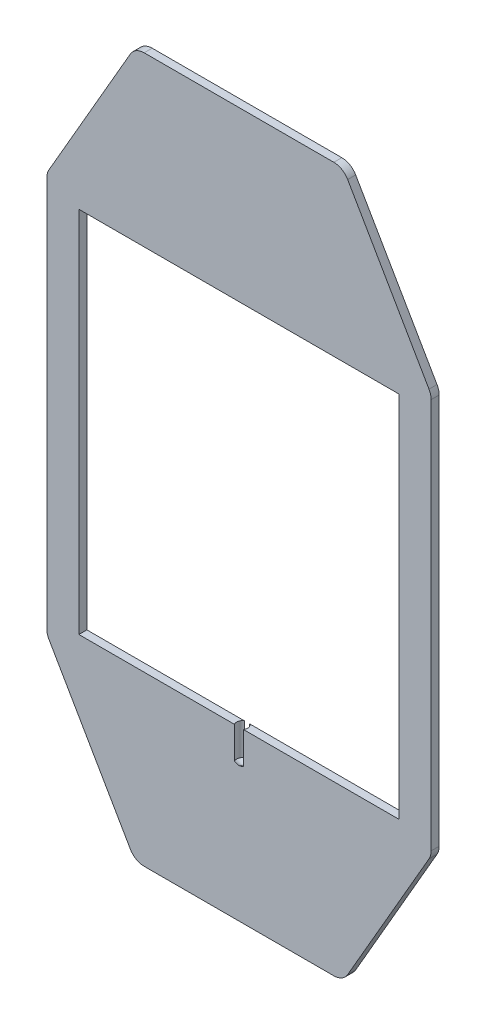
ISO-10303-21;
HEADER;
FILE_DESCRIPTION(('STEP AP214'),'2;1');
FILE_NAME('part.step','',(''),(''),'','','');
FILE_SCHEMA(('AUTOMOTIVE_DESIGN { 1 0 10303 214 1 1 1 1 }'));
ENDSEC;
DATA;
#1=APPLICATION_CONTEXT('core data for automotive mechanical design processes');
#2=APPLICATION_PROTOCOL_DEFINITION('international standard','automotive_design',2000,#1);
#3=PRODUCT_CONTEXT('',#1,'mechanical');
#4=PRODUCT('Part','Part','',(#3));
#5=PRODUCT_RELATED_PRODUCT_CATEGORY('part','',(#4));
#6=PRODUCT_DEFINITION_FORMATION('','',#4);
#7=PRODUCT_DEFINITION_CONTEXT('part definition',#1,'design');
#8=PRODUCT_DEFINITION('design','',#6,#7);
#9=PRODUCT_DEFINITION_SHAPE('','',#8);
#10=(LENGTH_UNIT() NAMED_UNIT(*) SI_UNIT(.MILLI.,.METRE.));
#11=(NAMED_UNIT(*) PLANE_ANGLE_UNIT() SI_UNIT($,.RADIAN.));
#12=(NAMED_UNIT(*) SI_UNIT($,.STERADIAN.) SOLID_ANGLE_UNIT());
#13=UNCERTAINTY_MEASURE_WITH_UNIT(LENGTH_MEASURE(1.E-05),#10,'distance_accuracy_value','');
#14=(GEOMETRIC_REPRESENTATION_CONTEXT(3) GLOBAL_UNCERTAINTY_ASSIGNED_CONTEXT((#13)) GLOBAL_UNIT_ASSIGNED_CONTEXT((#10,
#11,#12)) REPRESENTATION_CONTEXT('',''));
#15=CARTESIAN_POINT('',(0.,0.,0.));
#16=DIRECTION('',(0.,0.,1.));
#17=DIRECTION('',(1.,0.,0.));
#18=AXIS2_PLACEMENT_3D('',#15,#16,#17);
#19=CARTESIAN_POINT('',(-37.5,-115.,-10.));
#20=DIRECTION('',(0.,-1.,0.));
#21=DIRECTION('',(0.,0.,-1.));
#22=AXIS2_PLACEMENT_3D('',#19,#20,#21);
#23=PLANE('',#22);
#24=DIRECTION('',(0.,0.,1.));
#25=VECTOR('',#24,1.);
#26=CARTESIAN_POINT('',(-100.,-115.,-10.));
#27=LINE('',#26,#25);
#28=CARTESIAN_POINT('',(-99.9999999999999,-115.,-25.));
#29=VERTEX_POINT('',#28);
#30=CARTESIAN_POINT('',(-99.9999999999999,-115.,-20.));
#31=VERTEX_POINT('',#30);
#32=EDGE_CURVE('E268',#29,#31,#27,.T.);
#33=ORIENTED_EDGE('',*,*,#32,.T.);
#34=DIRECTION('',(1.,0.,0.));
#35=VECTOR('',#34,1.);
#36=CARTESIAN_POINT('',(0.,-115.,-20.));
#37=LINE('',#36,#35);
#38=CARTESIAN_POINT('',(-2.74954541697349,-115.,-20.));
#39=VERTEX_POINT('',#38);
#40=EDGE_CURVE('E263',#31,#39,#37,.T.);
#41=ORIENTED_EDGE('',*,*,#40,.T.);
#42=CARTESIAN_POINT('',(0.,-115.,-22.));
#43=DIRECTION('',(0.,1.,0.));
#44=DIRECTION('',(0.,0.,1.));
#45=AXIS2_PLACEMENT_3D('',#42,#43,#44);
#46=CIRCLE('',#45,3.39999999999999);
#47=CARTESIAN_POINT('',(-1.59999999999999,-115.,-25.));
#48=VERTEX_POINT('',#47);
#49=EDGE_CURVE('E42',#48,#39,#46,.T.);
#50=ORIENTED_EDGE('',*,*,#49,.F.);
#51=DIRECTION('',(-1.,0.,0.));
#52=VECTOR('',#51,1.);
#53=CARTESIAN_POINT('',(99.9999999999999,-115.,-25.));
#54=LINE('',#53,#52);
#55=EDGE_CURVE('E258',#48,#29,#54,.T.);
#56=ORIENTED_EDGE('',*,*,#55,.T.);
#57=EDGE_LOOP('',(#33,#41,#50,#56));
#58=FACE_BOUND('',#57,.T.);
#59=ADVANCED_FACE('F38',(#58),#23,.F.);
#60=CARTESIAN_POINT('',(0.,-115.,-22.));
#61=DIRECTION('',(0.,1.,0.));
#62=DIRECTION('',(0.,0.,1.));
#63=AXIS2_PLACEMENT_3D('',#60,#61,#62);
#64=CYLINDRICAL_SURFACE('',#63,3.39999999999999);
#65=ORIENTED_EDGE('',*,*,#49,.T.);
#66=DIRECTION('',(0.,1.,0.));
#67=VECTOR('',#66,1.);
#68=CARTESIAN_POINT('',(-2.74954541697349,-115.,-20.));
#69=LINE('',#68,#67);
#70=CARTESIAN_POINT('',(-2.74954541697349,-135.,-20.));
#71=VERTEX_POINT('',#70);
#72=EDGE_CURVE('E257',#39,#71,#69,.F.);
#73=ORIENTED_EDGE('',*,*,#72,.T.);
#74=CARTESIAN_POINT('',(0.,-135.,-22.));
#75=DIRECTION('',(0.,1.,0.));
#76=DIRECTION('',(0.,0.,1.));
#77=AXIS2_PLACEMENT_3D('',#74,#75,#76);
#78=CIRCLE('',#77,3.39999999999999);
#79=CARTESIAN_POINT('',(-1.6,-135.,-25.));
#80=VERTEX_POINT('',#79);
#81=EDGE_CURVE('E283',#80,#71,#78,.T.);
#82=ORIENTED_EDGE('',*,*,#81,.F.);
#83=DIRECTION('',(0.,1.,0.));
#84=VECTOR('',#83,1.);
#85=CARTESIAN_POINT('',(-1.59999999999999,-115.,-25.));
#86=LINE('',#85,#84);
#87=EDGE_CURVE('E261',#80,#48,#86,.T.);
#88=ORIENTED_EDGE('',*,*,#87,.T.);
#89=EDGE_LOOP('',(#65,#73,#82,#88));
#90=FACE_BOUND('',#89,.T.);
#91=ADVANCED_FACE('F221',(#90),#64,.F.);
#92=CARTESIAN_POINT('',(99.9999999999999,116.666666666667,30.));
#93=DIRECTION('',(-1.,0.,0.));
#94=DIRECTION('',(0.,-1.,0.));
#95=AXIS2_PLACEMENT_3D('',#92,#93,#94);
#96=PLANE('',#95);
#97=DIRECTION('',(0.,1.,0.));
#98=VECTOR('',#97,1.);
#99=CARTESIAN_POINT('',(99.9999999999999,0.,-20.));
#100=LINE('',#99,#98);
#101=CARTESIAN_POINT('',(99.9999999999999,-115.,-20.));
#102=VERTEX_POINT('',#101);
#103=CARTESIAN_POINT('',(99.9999999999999,115.,-20.));
#104=VERTEX_POINT('',#103);
#105=EDGE_CURVE('E127',#102,#104,#100,.T.);
#106=ORIENTED_EDGE('',*,*,#105,.T.);
#107=DIRECTION('',(0.,0.,1.));
#108=VECTOR('',#107,1.);
#109=CARTESIAN_POINT('',(100.,115.,-10.));
#110=LINE('',#109,#108);
#111=CARTESIAN_POINT('',(99.9999999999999,115.,-25.));
#112=VERTEX_POINT('',#111);
#113=EDGE_CURVE('E276',#112,#104,#110,.T.);
#114=ORIENTED_EDGE('',*,*,#113,.F.);
#115=DIRECTION('',(0.,-1.,0.));
#116=VECTOR('',#115,1.);
#117=CARTESIAN_POINT('',(99.9999999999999,115.,-25.));
#118=LINE('',#117,#116);
#119=CARTESIAN_POINT('',(99.9999999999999,-115.,-25.));
#120=VERTEX_POINT('',#119);
#121=EDGE_CURVE('E372',#112,#120,#118,.T.);
#122=ORIENTED_EDGE('',*,*,#121,.T.);
#123=DIRECTION('',(0.,0.,1.));
#124=VECTOR('',#123,1.);
#125=CARTESIAN_POINT('',(100.,-115.,-10.));
#126=LINE('',#125,#124);
#127=EDGE_CURVE('E318',#120,#102,#126,.T.);
#128=ORIENTED_EDGE('',*,*,#127,.T.);
#129=EDGE_LOOP('',(#106,#114,#122,#128));
#130=FACE_BOUND('',#129,.T.);
#131=ADVANCED_FACE('F231',(#130),#96,.T.);
#132=CARTESIAN_POINT('',(-100.,116.666666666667,30.));
#133=DIRECTION('',(1.,0.,0.));
#134=DIRECTION('',(0.,1.,0.));
#135=AXIS2_PLACEMENT_3D('',#132,#133,#134);
#136=PLANE('',#135);
#137=DIRECTION('',(0.,-1.,0.));
#138=VECTOR('',#137,1.);
#139=CARTESIAN_POINT('',(-99.9999999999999,0.,-20.));
#140=LINE('',#139,#138);
#141=CARTESIAN_POINT('',(-99.9999999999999,115.,-20.));
#142=VERTEX_POINT('',#141);
#143=EDGE_CURVE('E315',#142,#31,#140,.T.);
#144=ORIENTED_EDGE('',*,*,#143,.T.);
#145=ORIENTED_EDGE('',*,*,#32,.F.);
#146=DIRECTION('',(0.,1.,0.));
#147=VECTOR('',#146,1.);
#148=CARTESIAN_POINT('',(-99.9999999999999,115.,-25.));
#149=LINE('',#148,#147);
#150=CARTESIAN_POINT('',(-99.9999999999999,115.,-25.));
#151=VERTEX_POINT('',#150);
#152=EDGE_CURVE('E317',#29,#151,#149,.T.);
#153=ORIENTED_EDGE('',*,*,#152,.T.);
#154=DIRECTION('',(0.,0.,-1.));
#155=VECTOR('',#154,1.);
#156=CARTESIAN_POINT('',(-100.,115.,30.));
#157=LINE('',#156,#155);
#158=EDGE_CURVE('E300',#142,#151,#157,.T.);
#159=ORIENTED_EDGE('',*,*,#158,.F.);
#160=EDGE_LOOP('',(#144,#145,#153,#159));
#161=FACE_BOUND('',#160,.T.);
#162=ADVANCED_FACE('F245',(#161),#136,.T.);
#163=CARTESIAN_POINT('',(-37.5,115.,-10.));
#164=DIRECTION('',(0.,-1.,0.));
#165=DIRECTION('',(0.,0.,-1.));
#166=AXIS2_PLACEMENT_3D('',#163,#164,#165);
#167=PLANE('',#166);
#168=DIRECTION('',(-1.,0.,0.));
#169=VECTOR('',#168,1.);
#170=CARTESIAN_POINT('',(0.,115.,-20.));
#171=LINE('',#170,#169);
#172=EDGE_CURVE('E124',#104,#142,#171,.T.);
#173=ORIENTED_EDGE('',*,*,#172,.T.);
#174=ORIENTED_EDGE('',*,*,#158,.T.);
#175=DIRECTION('',(1.,0.,0.));
#176=VECTOR('',#175,1.);
#177=CARTESIAN_POINT('',(99.9999999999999,115.,-25.));
#178=LINE('',#177,#176);
#179=EDGE_CURVE('E279',#151,#112,#178,.T.);
#180=ORIENTED_EDGE('',*,*,#179,.T.);
#181=ORIENTED_EDGE('',*,*,#113,.T.);
#182=EDGE_LOOP('',(#173,#174,#180,#181));
#183=FACE_BOUND('',#182,.T.);
#184=ADVANCED_FACE('F236',(#183),#167,.T.);
#185=CARTESIAN_POINT('',(2.74954541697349,-115.,-20.));
#186=VERTEX_POINT('',#185);
#187=CARTESIAN_POINT('',(1.59999999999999,-115.,-25.));
#188=VERTEX_POINT('',#187);
#189=EDGE_CURVE('E48',#186,#188,#46,.T.);
#190=ORIENTED_EDGE('',*,*,#189,.F.);
#191=DIRECTION('',(1.,0.,0.));
#192=VECTOR('',#191,1.);
#193=CARTESIAN_POINT('',(0.,-115.,-20.));
#194=LINE('',#193,#192);
#195=EDGE_CURVE('E130',#186,#102,#194,.T.);
#196=ORIENTED_EDGE('',*,*,#195,.T.);
#197=ORIENTED_EDGE('',*,*,#127,.F.);
#198=EDGE_CURVE('E252',#120,#188,#54,.T.);
#199=ORIENTED_EDGE('',*,*,#198,.T.);
#200=EDGE_LOOP('',(#190,#196,#197,#199));
#201=FACE_BOUND('',#200,.T.);
#202=ADVANCED_FACE('F40',(#201),#23,.F.);
#203=CARTESIAN_POINT('',(118.660254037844,127.025650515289,30.));
#204=DIRECTION('',(-0.866025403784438,-0.500000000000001,0.));
#205=DIRECTION('',(0.500000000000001,-0.866025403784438,0.));
#206=AXIS2_PLACEMENT_3D('',#203,#204,#205);
#207=PLANE('',#206);
#208=DIRECTION('',(0.,0.,-1.));
#209=VECTOR('',#208,1.);
#210=CARTESIAN_POINT('',(67.8682396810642,215.,30.));
#211=LINE('',#210,#209);
#212=CARTESIAN_POINT('',(67.8682396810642,215.,-20.));
#213=VERTEX_POINT('',#212);
#214=CARTESIAN_POINT('',(67.8682396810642,215.,-25.));
#215=VERTEX_POINT('',#214);
#216=EDGE_CURVE('E392',#213,#215,#211,.T.);
#217=ORIENTED_EDGE('',*,*,#216,.F.);
#218=DIRECTION('',(0.500000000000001,-0.866025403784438,0.));
#219=VECTOR('',#218,1.);
#220=CARTESIAN_POINT('',(118.660254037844,127.025650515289,-20.));
#221=LINE('',#220,#219);
#222=CARTESIAN_POINT('',(118.660254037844,127.025650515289,-20.));
#223=VERTEX_POINT('',#222);
#224=EDGE_CURVE('E272',#213,#223,#221,.T.);
#225=ORIENTED_EDGE('',*,*,#224,.T.);
#226=DIRECTION('',(0.,0.,-1.));
#227=VECTOR('',#226,1.);
#228=CARTESIAN_POINT('',(118.660254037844,127.025650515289,30.));
#229=LINE('',#228,#227);
#230=CARTESIAN_POINT('',(118.660254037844,127.025650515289,-25.));
#231=VERTEX_POINT('',#230);
#232=EDGE_CURVE('E274',#223,#231,#229,.T.);
#233=ORIENTED_EDGE('',*,*,#232,.T.);
#234=DIRECTION('',(0.500000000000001,-0.866025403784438,0.));
#235=VECTOR('',#234,1.);
#236=CARTESIAN_POINT('',(67.8682396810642,215.,-25.));
#237=LINE('',#236,#235);
#238=EDGE_CURVE('E349',#215,#231,#237,.T.);
#239=ORIENTED_EDGE('',*,*,#238,.F.);
#240=EDGE_LOOP('',(#217,#225,#233,#239));
#241=FACE_BOUND('',#240,.T.);
#242=ADVANCED_FACE('F235',(#241),#207,.F.);
#243=CARTESIAN_POINT('',(118.660254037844,-127.025650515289,30.));
#244=DIRECTION('',(-0.866025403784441,0.499999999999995,0.));
#245=DIRECTION('',(-0.499999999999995,-0.866025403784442,0.));
#246=AXIS2_PLACEMENT_3D('',#243,#244,#245);
#247=PLANE('',#246);
#248=DIRECTION('',(0.,0.,-1.));
#249=VECTOR('',#248,1.);
#250=CARTESIAN_POINT('',(118.660254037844,-127.025650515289,30.));
#251=LINE('',#250,#249);
#252=CARTESIAN_POINT('',(118.660254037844,-127.025650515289,-20.));
#253=VERTEX_POINT('',#252);
#254=CARTESIAN_POINT('',(118.660254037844,-127.025650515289,-25.));
#255=VERTEX_POINT('',#254);
#256=EDGE_CURVE('E403',#253,#255,#251,.T.);
#257=ORIENTED_EDGE('',*,*,#256,.F.);
#258=DIRECTION('',(-0.499999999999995,-0.866025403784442,0.));
#259=VECTOR('',#258,1.);
#260=CARTESIAN_POINT('',(118.660254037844,-127.025650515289,-20.));
#261=LINE('',#260,#259);
#262=CARTESIAN_POINT('',(67.8682396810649,-215.,-20.));
#263=VERTEX_POINT('',#262);
#264=EDGE_CURVE('E396',#253,#263,#261,.T.);
#265=ORIENTED_EDGE('',*,*,#264,.T.);
#266=DIRECTION('',(0.,0.,-1.));
#267=VECTOR('',#266,1.);
#268=CARTESIAN_POINT('',(67.8682396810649,-215.,30.));
#269=LINE('',#268,#267);
#270=CARTESIAN_POINT('',(67.8682396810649,-215.,-25.));
#271=VERTEX_POINT('',#270);
#272=EDGE_CURVE('E406',#263,#271,#269,.T.);
#273=ORIENTED_EDGE('',*,*,#272,.T.);
#274=DIRECTION('',(-0.499999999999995,-0.866025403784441,0.));
#275=VECTOR('',#274,1.);
#276=CARTESIAN_POINT('',(118.660254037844,-127.025650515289,-25.));
#277=LINE('',#276,#275);
#278=EDGE_CURVE('E361',#255,#271,#277,.T.);
#279=ORIENTED_EDGE('',*,*,#278,.F.);
#280=EDGE_LOOP('',(#257,#265,#273,#279));
#281=FACE_BOUND('',#280,.T.);
#282=ADVANCED_FACE('F242',(#281),#247,.F.);
#283=CARTESIAN_POINT('',(110.,-122.025650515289,30.));
#284=DIRECTION('',(0.,0.,-1.));
#285=DIRECTION('',(-1.,0.,0.));
#286=AXIS2_PLACEMENT_3D('',#283,#284,#285);
#287=CYLINDRICAL_SURFACE('',#286,9.99999999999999);
#288=DIRECTION('',(0.,0.,-1.));
#289=VECTOR('',#288,1.);
#290=CARTESIAN_POINT('',(120.,-122.025650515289,30.));
#291=LINE('',#290,#289);
#292=CARTESIAN_POINT('',(120.,-122.025650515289,-20.));
#293=VERTEX_POINT('',#292);
#294=CARTESIAN_POINT('',(120.,-122.025650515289,-25.));
#295=VERTEX_POINT('',#294);
#296=EDGE_CURVE('E400',#293,#295,#291,.T.);
#297=ORIENTED_EDGE('',*,*,#296,.F.);
#298=CARTESIAN_POINT('',(110.,-122.025650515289,-20.));
#299=DIRECTION('',(0.,0.,-1.));
#300=DIRECTION('',(-1.,0.,0.));
#301=AXIS2_PLACEMENT_3D('',#298,#299,#300);
#302=CIRCLE('',#301,9.99999999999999);
#303=EDGE_CURVE('E405',#293,#253,#302,.T.);
#304=ORIENTED_EDGE('',*,*,#303,.T.);
#305=ORIENTED_EDGE('',*,*,#256,.T.);
#306=CARTESIAN_POINT('',(110.,-122.025650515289,-25.));
#307=DIRECTION('',(0.,0.,-1.));
#308=DIRECTION('',(-1.,0.,0.));
#309=AXIS2_PLACEMENT_3D('',#306,#307,#308);
#310=CIRCLE('',#309,9.99999999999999);
#311=EDGE_CURVE('E358',#295,#255,#310,.T.);
#312=ORIENTED_EDGE('',*,*,#311,.F.);
#313=EDGE_LOOP('',(#297,#304,#305,#312));
#314=FACE_BOUND('',#313,.T.);
#315=ADVANCED_FACE('F475',(#314),#287,.T.);
#316=CARTESIAN_POINT('',(120.,122.025650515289,30.));
#317=DIRECTION('',(-1.,0.,0.));
#318=DIRECTION('',(0.,-1.,0.));
#319=AXIS2_PLACEMENT_3D('',#316,#317,#318);
#320=PLANE('',#319);
#321=DIRECTION('',(0.,0.,-1.));
#322=VECTOR('',#321,1.);
#323=CARTESIAN_POINT('',(120.,122.025650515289,30.));
#324=LINE('',#323,#322);
#325=CARTESIAN_POINT('',(120.,122.025650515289,-20.));
#326=VERTEX_POINT('',#325);
#327=CARTESIAN_POINT('',(120.,122.025650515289,-25.));
#328=VERTEX_POINT('',#327);
#329=EDGE_CURVE('E397',#326,#328,#324,.T.);
#330=ORIENTED_EDGE('',*,*,#329,.F.);
#331=DIRECTION('',(0.,-1.,0.));
#332=VECTOR('',#331,1.);
#333=CARTESIAN_POINT('',(120.,122.025650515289,-20.));
#334=LINE('',#333,#332);
#335=EDGE_CURVE('E402',#326,#293,#334,.T.);
#336=ORIENTED_EDGE('',*,*,#335,.T.);
#337=ORIENTED_EDGE('',*,*,#296,.T.);
#338=DIRECTION('',(0.,-1.,0.));
#339=VECTOR('',#338,1.);
#340=CARTESIAN_POINT('',(120.,122.025650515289,-25.));
#341=LINE('',#340,#339);
#342=EDGE_CURVE('E355',#328,#295,#341,.T.);
#343=ORIENTED_EDGE('',*,*,#342,.F.);
#344=EDGE_LOOP('',(#330,#336,#337,#343));
#345=FACE_BOUND('',#344,.T.);
#346=ADVANCED_FACE('F470',(#345),#320,.F.);
#347=CARTESIAN_POINT('',(110.,122.025650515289,30.));
#348=DIRECTION('',(0.,0.,-1.));
#349=DIRECTION('',(-1.,0.,0.));
#350=AXIS2_PLACEMENT_3D('',#347,#348,#349);
#351=CYLINDRICAL_SURFACE('',#350,10.);
#352=ORIENTED_EDGE('',*,*,#232,.F.);
#353=CARTESIAN_POINT('',(110.,122.025650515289,-20.));
#354=DIRECTION('',(0.,0.,-1.));
#355=DIRECTION('',(-1.,0.,0.));
#356=AXIS2_PLACEMENT_3D('',#353,#354,#355);
#357=CIRCLE('',#356,10.);
#358=EDGE_CURVE('E399',#223,#326,#357,.T.);
#359=ORIENTED_EDGE('',*,*,#358,.T.);
#360=ORIENTED_EDGE('',*,*,#329,.T.);
#361=CARTESIAN_POINT('',(110.,122.025650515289,-25.));
#362=DIRECTION('',(0.,0.,-1.));
#363=DIRECTION('',(-1.,0.,0.));
#364=AXIS2_PLACEMENT_3D('',#361,#362,#363);
#365=CIRCLE('',#364,9.99999999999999);
#366=EDGE_CURVE('E352',#231,#328,#365,.T.);
#367=ORIENTED_EDGE('',*,*,#366,.F.);
#368=EDGE_LOOP('',(#352,#359,#360,#367));
#369=FACE_BOUND('',#368,.T.);
#370=ADVANCED_FACE('F465',(#369),#351,.T.);
#371=CARTESIAN_POINT('',(59.2079856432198,210.,30.));
#372=DIRECTION('',(0.,0.,-1.));
#373=DIRECTION('',(-1.,0.,0.));
#374=AXIS2_PLACEMENT_3D('',#371,#372,#373);
#375=CYLINDRICAL_SURFACE('',#374,10.);
#376=DIRECTION('',(0.,0.,-1.));
#377=VECTOR('',#376,1.);
#378=CARTESIAN_POINT('',(59.2079856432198,220.,30.));
#379=LINE('',#378,#377);
#380=CARTESIAN_POINT('',(59.2079856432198,220.,-20.));
#381=VERTEX_POINT('',#380);
#382=CARTESIAN_POINT('',(59.2079856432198,220.,-25.));
#383=VERTEX_POINT('',#382);
#384=EDGE_CURVE('E389',#381,#383,#379,.T.);
#385=ORIENTED_EDGE('',*,*,#384,.F.);
#386=CARTESIAN_POINT('',(59.2079856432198,210.,-20.));
#387=DIRECTION('',(0.,0.,-1.));
#388=DIRECTION('',(-1.,0.,0.));
#389=AXIS2_PLACEMENT_3D('',#386,#387,#388);
#390=CIRCLE('',#389,10.);
#391=EDGE_CURVE('E394',#381,#213,#390,.T.);
#392=ORIENTED_EDGE('',*,*,#391,.T.);
#393=ORIENTED_EDGE('',*,*,#216,.T.);
#394=CARTESIAN_POINT('',(59.2079856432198,210.,-25.));
#395=DIRECTION('',(0.,0.,-1.));
#396=DIRECTION('',(-1.,0.,0.));
#397=AXIS2_PLACEMENT_3D('',#394,#395,#396);
#398=CIRCLE('',#397,10.);
#399=EDGE_CURVE('E346',#383,#215,#398,.T.);
#400=ORIENTED_EDGE('',*,*,#399,.F.);
#401=EDGE_LOOP('',(#385,#392,#393,#400));
#402=FACE_BOUND('',#401,.T.);
#403=ADVANCED_FACE('F459',(#402),#375,.T.);
#404=CARTESIAN_POINT('',(59.2079856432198,220.,30.));
#405=DIRECTION('',(0.,-1.,0.));
#406=DIRECTION('',(0.,0.,-1.));
#407=AXIS2_PLACEMENT_3D('',#404,#405,#406);
#408=PLANE('',#407);
#409=DIRECTION('',(0.,0.,-1.));
#410=VECTOR('',#409,1.);
#411=CARTESIAN_POINT('',(-59.2079856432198,220.,30.));
#412=LINE('',#411,#410);
#413=CARTESIAN_POINT('',(-59.2079856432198,220.,-20.));
#414=VERTEX_POINT('',#413);
#415=CARTESIAN_POINT('',(-59.2079856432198,220.,-25.));
#416=VERTEX_POINT('',#415);
#417=EDGE_CURVE('E386',#414,#416,#412,.T.);
#418=ORIENTED_EDGE('',*,*,#417,.F.);
#419=DIRECTION('',(1.,0.,0.));
#420=VECTOR('',#419,1.);
#421=CARTESIAN_POINT('',(59.2079856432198,220.,-20.));
#422=LINE('',#421,#420);
#423=EDGE_CURVE('E391',#414,#381,#422,.T.);
#424=ORIENTED_EDGE('',*,*,#423,.T.);
#425=ORIENTED_EDGE('',*,*,#384,.T.);
#426=DIRECTION('',(1.,0.,0.));
#427=VECTOR('',#426,1.);
#428=CARTESIAN_POINT('',(-59.2079856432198,220.,-25.));
#429=LINE('',#428,#427);
#430=EDGE_CURVE('E343',#416,#383,#429,.T.);
#431=ORIENTED_EDGE('',*,*,#430,.F.);
#432=EDGE_LOOP('',(#418,#424,#425,#431));
#433=FACE_BOUND('',#432,.T.);
#434=ADVANCED_FACE('F454',(#433),#408,.F.);
#435=CARTESIAN_POINT('',(-59.2079856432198,210.,30.));
#436=DIRECTION('',(0.,0.,-1.));
#437=DIRECTION('',(-1.,0.,0.));
#438=AXIS2_PLACEMENT_3D('',#435,#436,#437);
#439=CYLINDRICAL_SURFACE('',#438,10.);
#440=DIRECTION('',(0.,0.,-1.));
#441=VECTOR('',#440,1.);
#442=CARTESIAN_POINT('',(-67.8682396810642,215.,30.));
#443=LINE('',#442,#441);
#444=CARTESIAN_POINT('',(-67.8682396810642,215.,-20.));
#445=VERTEX_POINT('',#444);
#446=CARTESIAN_POINT('',(-67.8682396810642,215.,-25.));
#447=VERTEX_POINT('',#446);
#448=EDGE_CURVE('E383',#445,#447,#443,.T.);
#449=ORIENTED_EDGE('',*,*,#448,.F.);
#450=CARTESIAN_POINT('',(-59.2079856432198,210.,-20.));
#451=DIRECTION('',(0.,0.,-1.));
#452=DIRECTION('',(-1.,0.,0.));
#453=AXIS2_PLACEMENT_3D('',#450,#451,#452);
#454=CIRCLE('',#453,10.);
#455=EDGE_CURVE('E388',#445,#414,#454,.T.);
#456=ORIENTED_EDGE('',*,*,#455,.T.);
#457=ORIENTED_EDGE('',*,*,#417,.T.);
#458=CARTESIAN_POINT('',(-59.2079856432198,210.,-25.));
#459=DIRECTION('',(0.,0.,-1.));
#460=DIRECTION('',(-1.,0.,0.));
#461=AXIS2_PLACEMENT_3D('',#458,#459,#460);
#462=CIRCLE('',#461,10.);
#463=EDGE_CURVE('E340',#447,#416,#462,.T.);
#464=ORIENTED_EDGE('',*,*,#463,.F.);
#465=EDGE_LOOP('',(#449,#456,#457,#464));
#466=FACE_BOUND('',#465,.T.);
#467=ADVANCED_FACE('F451',(#466),#439,.T.);
#468=CARTESIAN_POINT('',(-118.660254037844,127.025650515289,30.));
#469=DIRECTION('',(0.866025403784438,-0.500000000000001,0.));
#470=DIRECTION('',(0.500000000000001,0.866025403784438,0.));
#471=AXIS2_PLACEMENT_3D('',#468,#469,#470);
#472=PLANE('',#471);
#473=DIRECTION('',(0.,0.,-1.));
#474=VECTOR('',#473,1.);
#475=CARTESIAN_POINT('',(-118.660254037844,127.025650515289,30.));
#476=LINE('',#475,#474);
#477=CARTESIAN_POINT('',(-118.660254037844,127.025650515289,-20.));
#478=VERTEX_POINT('',#477);
#479=CARTESIAN_POINT('',(-118.660254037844,127.025650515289,-25.));
#480=VERTEX_POINT('',#479);
#481=EDGE_CURVE('E380',#478,#480,#476,.T.);
#482=ORIENTED_EDGE('',*,*,#481,.F.);
#483=DIRECTION('',(0.500000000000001,0.866025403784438,0.));
#484=VECTOR('',#483,1.);
#485=CARTESIAN_POINT('',(-118.660254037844,127.025650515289,-20.));
#486=LINE('',#485,#484);
#487=EDGE_CURVE('E385',#478,#445,#486,.T.);
#488=ORIENTED_EDGE('',*,*,#487,.T.);
#489=ORIENTED_EDGE('',*,*,#448,.T.);
#490=DIRECTION('',(0.500000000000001,0.866025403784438,0.));
#491=VECTOR('',#490,1.);
#492=CARTESIAN_POINT('',(-118.660254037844,127.025650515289,-25.));
#493=LINE('',#492,#491);
#494=EDGE_CURVE('E337',#480,#447,#493,.T.);
#495=ORIENTED_EDGE('',*,*,#494,.F.);
#496=EDGE_LOOP('',(#482,#488,#489,#495));
#497=FACE_BOUND('',#496,.T.);
#498=ADVANCED_FACE('F445',(#497),#472,.F.);
#499=CARTESIAN_POINT('',(-110.,-122.025650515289,30.));
#500=DIRECTION('',(0.,0.,-1.));
#501=DIRECTION('',(-1.,0.,0.));
#502=AXIS2_PLACEMENT_3D('',#499,#500,#501);
#503=CYLINDRICAL_SURFACE('',#502,9.99999999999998);
#504=DIRECTION('',(0.,0.,-1.));
#505=VECTOR('',#504,1.);
#506=CARTESIAN_POINT('',(-118.660254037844,-127.025650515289,30.));
#507=LINE('',#506,#505);
#508=CARTESIAN_POINT('',(-118.660254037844,-127.025650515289,-20.));
#509=VERTEX_POINT('',#508);
#510=CARTESIAN_POINT('',(-118.660254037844,-127.025650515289,-25.));
#511=VERTEX_POINT('',#510);
#512=EDGE_CURVE('E415',#509,#511,#507,.T.);
#513=ORIENTED_EDGE('',*,*,#512,.F.);
#514=CARTESIAN_POINT('',(-110.,-122.025650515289,-20.));
#515=DIRECTION('',(0.,0.,-1.));
#516=DIRECTION('',(-1.,0.,0.));
#517=AXIS2_PLACEMENT_3D('',#514,#515,#516);
#518=CIRCLE('',#517,9.99999999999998);
#519=CARTESIAN_POINT('',(-120.,-122.025650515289,-20.));
#520=VERTEX_POINT('',#519);
#521=EDGE_CURVE('E378',#509,#520,#518,.T.);
#522=ORIENTED_EDGE('',*,*,#521,.T.);
#523=DIRECTION('',(0.,0.,-1.));
#524=VECTOR('',#523,1.);
#525=CARTESIAN_POINT('',(-120.,-122.025650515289,30.));
#526=LINE('',#525,#524);
#527=CARTESIAN_POINT('',(-120.,-122.025650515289,-25.));
#528=VERTEX_POINT('',#527);
#529=EDGE_CURVE('E375',#520,#528,#526,.T.);
#530=ORIENTED_EDGE('',*,*,#529,.T.);
#531=CARTESIAN_POINT('',(-110.,-122.025650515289,-25.));
#532=DIRECTION('',(0.,0.,-1.));
#533=DIRECTION('',(-1.,0.,0.));
#534=AXIS2_PLACEMENT_3D('',#531,#532,#533);
#535=CIRCLE('',#534,9.99999999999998);
#536=EDGE_CURVE('E327',#511,#528,#535,.T.);
#537=ORIENTED_EDGE('',*,*,#536,.F.);
#538=EDGE_LOOP('',(#513,#522,#530,#537));
#539=FACE_BOUND('',#538,.T.);
#540=ADVANCED_FACE('F496',(#539),#503,.T.);
#541=CARTESIAN_POINT('',(-118.660254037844,-127.025650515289,30.));
#542=DIRECTION('',(0.866025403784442,0.499999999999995,0.));
#543=DIRECTION('',(-0.499999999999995,0.866025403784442,0.));
#544=AXIS2_PLACEMENT_3D('',#541,#542,#543);
#545=PLANE('',#544);
#546=DIRECTION('',(0.,0.,-1.));
#547=VECTOR('',#546,1.);
#548=CARTESIAN_POINT('',(-67.8682396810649,-215.,30.));
#549=LINE('',#548,#547);
#550=CARTESIAN_POINT('',(-67.8682396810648,-215.,-20.));
#551=VERTEX_POINT('',#550);
#552=CARTESIAN_POINT('',(-67.8682396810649,-215.,-25.));
#553=VERTEX_POINT('',#552);
#554=EDGE_CURVE('E414',#551,#553,#549,.T.);
#555=ORIENTED_EDGE('',*,*,#554,.F.);
#556=DIRECTION('',(-0.499999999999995,0.866025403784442,0.));
#557=VECTOR('',#556,1.);
#558=CARTESIAN_POINT('',(-118.660254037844,-127.025650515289,-20.));
#559=LINE('',#558,#557);
#560=EDGE_CURVE('E377',#551,#509,#559,.T.);
#561=ORIENTED_EDGE('',*,*,#560,.T.);
#562=ORIENTED_EDGE('',*,*,#512,.T.);
#563=DIRECTION('',(-0.499999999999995,0.866025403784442,0.));
#564=VECTOR('',#563,1.);
#565=CARTESIAN_POINT('',(-67.8682396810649,-215.,-25.));
#566=LINE('',#565,#564);
#567=EDGE_CURVE('E285',#553,#511,#566,.T.);
#568=ORIENTED_EDGE('',*,*,#567,.F.);
#569=EDGE_LOOP('',(#555,#561,#562,#568));
#570=FACE_BOUND('',#569,.T.);
#571=ADVANCED_FACE('F493',(#570),#545,.F.);
#572=CARTESIAN_POINT('',(-59.2079856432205,-210.,30.));
#573=DIRECTION('',(0.,0.,-1.));
#574=DIRECTION('',(-1.,0.,0.));
#575=AXIS2_PLACEMENT_3D('',#572,#573,#574);
#576=CYLINDRICAL_SURFACE('',#575,10.);
#577=DIRECTION('',(0.,0.,-1.));
#578=VECTOR('',#577,1.);
#579=CARTESIAN_POINT('',(-59.2079856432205,-220.,30.));
#580=LINE('',#579,#578);
#581=CARTESIAN_POINT('',(-59.2079856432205,-220.,-20.));
#582=VERTEX_POINT('',#581);
#583=CARTESIAN_POINT('',(-59.2079856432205,-220.,-25.));
#584=VERTEX_POINT('',#583);
#585=EDGE_CURVE('E411',#582,#584,#580,.T.);
#586=ORIENTED_EDGE('',*,*,#585,.F.);
#587=CARTESIAN_POINT('',(-59.2079856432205,-210.,-20.));
#588=DIRECTION('',(0.,0.,-1.));
#589=DIRECTION('',(-1.,0.,0.));
#590=AXIS2_PLACEMENT_3D('',#587,#588,#589);
#591=CIRCLE('',#590,10.);
#592=EDGE_CURVE('E57',#582,#551,#591,.T.);
#593=ORIENTED_EDGE('',*,*,#592,.T.);
#594=ORIENTED_EDGE('',*,*,#554,.T.);
#595=CARTESIAN_POINT('',(-59.2079856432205,-210.,-25.));
#596=DIRECTION('',(0.,0.,-1.));
#597=DIRECTION('',(-1.,0.,0.));
#598=AXIS2_PLACEMENT_3D('',#595,#596,#597);
#599=CIRCLE('',#598,10.);
#600=EDGE_CURVE('E290',#584,#553,#599,.T.);
#601=ORIENTED_EDGE('',*,*,#600,.F.);
#602=EDGE_LOOP('',(#586,#593,#594,#601));
#603=FACE_BOUND('',#602,.T.);
#604=ADVANCED_FACE('F492',(#603),#576,.T.);
#605=CARTESIAN_POINT('',(59.2079856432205,-220.,30.));
#606=DIRECTION('',(0.,1.,0.));
#607=DIRECTION('',(0.,0.,1.));
#608=AXIS2_PLACEMENT_3D('',#605,#606,#607);
#609=PLANE('',#608);
#610=DIRECTION('',(0.,0.,-1.));
#611=VECTOR('',#610,1.);
#612=CARTESIAN_POINT('',(59.2079856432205,-220.,30.));
#613=LINE('',#612,#611);
#614=CARTESIAN_POINT('',(59.2079856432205,-220.,-20.));
#615=VERTEX_POINT('',#614);
#616=CARTESIAN_POINT('',(59.2079856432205,-220.,-25.));
#617=VERTEX_POINT('',#616);
#618=EDGE_CURVE('E408',#615,#617,#613,.T.);
#619=ORIENTED_EDGE('',*,*,#618,.F.);
#620=DIRECTION('',(-1.,0.,0.));
#621=VECTOR('',#620,1.);
#622=CARTESIAN_POINT('',(59.2079856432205,-220.,-20.));
#623=LINE('',#622,#621);
#624=EDGE_CURVE('E413',#615,#582,#623,.T.);
#625=ORIENTED_EDGE('',*,*,#624,.T.);
#626=ORIENTED_EDGE('',*,*,#585,.T.);
#627=DIRECTION('',(-1.,0.,0.));
#628=VECTOR('',#627,1.);
#629=CARTESIAN_POINT('',(59.2079856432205,-220.,-25.));
#630=LINE('',#629,#628);
#631=EDGE_CURVE('E367',#617,#584,#630,.T.);
#632=ORIENTED_EDGE('',*,*,#631,.F.);
#633=EDGE_LOOP('',(#619,#625,#626,#632));
#634=FACE_BOUND('',#633,.T.);
#635=ADVANCED_FACE('F488',(#634),#609,.F.);
#636=CARTESIAN_POINT('',(59.2079856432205,-210.,30.));
#637=DIRECTION('',(0.,0.,-1.));
#638=DIRECTION('',(-1.,0.,0.));
#639=AXIS2_PLACEMENT_3D('',#636,#637,#638);
#640=CYLINDRICAL_SURFACE('',#639,10.);
#641=ORIENTED_EDGE('',*,*,#272,.F.);
#642=CARTESIAN_POINT('',(59.2079856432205,-210.,-20.));
#643=DIRECTION('',(0.,0.,-1.));
#644=DIRECTION('',(-1.,0.,0.));
#645=AXIS2_PLACEMENT_3D('',#642,#643,#644);
#646=CIRCLE('',#645,10.);
#647=EDGE_CURVE('E410',#263,#615,#646,.T.);
#648=ORIENTED_EDGE('',*,*,#647,.T.);
#649=ORIENTED_EDGE('',*,*,#618,.T.);
#650=CARTESIAN_POINT('',(59.2079856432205,-210.,-25.));
#651=DIRECTION('',(0.,0.,-1.));
#652=DIRECTION('',(-1.,0.,0.));
#653=AXIS2_PLACEMENT_3D('',#650,#651,#652);
#654=CIRCLE('',#653,10.);
#655=EDGE_CURVE('E364',#271,#617,#654,.T.);
#656=ORIENTED_EDGE('',*,*,#655,.F.);
#657=EDGE_LOOP('',(#641,#648,#649,#656));
#658=FACE_BOUND('',#657,.T.);
#659=ADVANCED_FACE('F484',(#658),#640,.T.);
#660=CARTESIAN_POINT('',(-110.,122.025650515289,30.));
#661=DIRECTION('',(0.,0.,-1.));
#662=DIRECTION('',(-1.,0.,0.));
#663=AXIS2_PLACEMENT_3D('',#660,#661,#662);
#664=CYLINDRICAL_SURFACE('',#663,10.);
#665=DIRECTION('',(0.,0.,-1.));
#666=VECTOR('',#665,1.);
#667=CARTESIAN_POINT('',(-120.,122.025650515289,30.));
#668=LINE('',#667,#666);
#669=CARTESIAN_POINT('',(-120.,122.025650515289,-20.));
#670=VERTEX_POINT('',#669);
#671=CARTESIAN_POINT('',(-120.,122.025650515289,-25.));
#672=VERTEX_POINT('',#671);
#673=EDGE_CURVE('E331',#670,#672,#668,.T.);
#674=ORIENTED_EDGE('',*,*,#673,.F.);
#675=CARTESIAN_POINT('',(-110.,122.025650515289,-20.));
#676=DIRECTION('',(0.,0.,-1.));
#677=DIRECTION('',(-1.,0.,0.));
#678=AXIS2_PLACEMENT_3D('',#675,#676,#677);
#679=CIRCLE('',#678,10.);
#680=EDGE_CURVE('E382',#670,#478,#679,.T.);
#681=ORIENTED_EDGE('',*,*,#680,.T.);
#682=ORIENTED_EDGE('',*,*,#481,.T.);
#683=CARTESIAN_POINT('',(-110.,122.025650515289,-25.));
#684=DIRECTION('',(0.,0.,-1.));
#685=DIRECTION('',(-1.,0.,0.));
#686=AXIS2_PLACEMENT_3D('',#683,#684,#685);
#687=CIRCLE('',#686,10.);
#688=EDGE_CURVE('E334',#672,#480,#687,.T.);
#689=ORIENTED_EDGE('',*,*,#688,.F.);
#690=EDGE_LOOP('',(#674,#681,#682,#689));
#691=FACE_BOUND('',#690,.T.);
#692=ADVANCED_FACE('F440',(#691),#664,.T.);
#693=CARTESIAN_POINT('',(-120.,122.025650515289,30.));
#694=DIRECTION('',(1.,0.,0.));
#695=DIRECTION('',(0.,1.,0.));
#696=AXIS2_PLACEMENT_3D('',#693,#694,#695);
#697=PLANE('',#696);
#698=ORIENTED_EDGE('',*,*,#529,.F.);
#699=DIRECTION('',(0.,1.,0.));
#700=VECTOR('',#699,1.);
#701=CARTESIAN_POINT('',(-120.,122.025650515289,-20.));
#702=LINE('',#701,#700);
#703=EDGE_CURVE('E313',#520,#670,#702,.T.);
#704=ORIENTED_EDGE('',*,*,#703,.T.);
#705=ORIENTED_EDGE('',*,*,#673,.T.);
#706=DIRECTION('',(0.,1.,0.));
#707=VECTOR('',#706,1.);
#708=CARTESIAN_POINT('',(-120.,-122.025650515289,-25.));
#709=LINE('',#708,#707);
#710=EDGE_CURVE('E330',#528,#672,#709,.T.);
#711=ORIENTED_EDGE('',*,*,#710,.F.);
#712=EDGE_LOOP('',(#698,#704,#705,#711));
#713=FACE_BOUND('',#712,.T.);
#714=ADVANCED_FACE('F222',(#713),#697,.F.);
#715=CARTESIAN_POINT('',(-110.,-122.025650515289,-25.));
#716=DIRECTION('',(0.,0.,-1.));
#717=DIRECTION('',(-1.,0.,0.));
#718=AXIS2_PLACEMENT_3D('',#715,#716,#717);
#719=PLANE('',#718);
#720=ORIENTED_EDGE('',*,*,#87,.F.);
#721=CARTESIAN_POINT('',(-16.2184046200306,-127.132611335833,-25.));
#722=CARTESIAN_POINT('',(-15.7092292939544,-127.433423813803,-25.));
#723=CARTESIAN_POINT('',(-15.1998707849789,-127.733927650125,-25.));
#724=CARTESIAN_POINT('',(-14.1798951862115,-128.334413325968,-25.));
#725=CARTESIAN_POINT('',(-13.6692773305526,-128.634393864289,-25.));
#726=CARTESIAN_POINT('',(-12.6326647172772,-129.241667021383,-25.));
#727=CARTESIAN_POINT('',(-12.1066484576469,-129.548922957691,-25.));
#728=CARTESIAN_POINT('',(-11.0542278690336,-130.161080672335,-25.));
#729=CARTESIAN_POINT('',(-10.5278251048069,-130.465985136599,-25.));
#730=CARTESIAN_POINT('',(-9.64128743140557,-130.976201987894,-25.));
#731=CARTESIAN_POINT('',(-9.2816045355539,-131.182299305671,-25.));
#732=CARTESIAN_POINT('',(-8.56112299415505,-131.59263421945,-25.));
#733=CARTESIAN_POINT('',(-8.20032422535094,-131.796871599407,-25.));
#734=CARTESIAN_POINT('',(-7.47545341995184,-132.203646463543,-25.));
#735=CARTESIAN_POINT('',(-7.11137400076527,-132.406170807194,-25.));
#736=CARTESIAN_POINT('',(-6.38114447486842,-132.807102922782,-25.));
#737=CARTESIAN_POINT('',(-6.01499531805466,-133.005512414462,-25.));
#738=CARTESIAN_POINT('',(-5.46718167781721,-133.296182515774,-25.));
#739=CARTESIAN_POINT('',(-5.28681921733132,-133.390894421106,-25.));
#740=CARTESIAN_POINT('',(-4.92504906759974,-133.578315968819,-25.));
#741=CARTESIAN_POINT('',(-4.74364135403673,-133.671025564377,-25.));
#742=CARTESIAN_POINT('',(-4.37918402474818,-133.853991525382,-25.));
#743=CARTESIAN_POINT('',(-4.19613205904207,-133.944243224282,-25.));
#744=CARTESIAN_POINT('',(-3.82834245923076,-134.121231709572,-25.));
#745=CARTESIAN_POINT('',(-3.64360493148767,-134.207968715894,-25.));
#746=CARTESIAN_POINT('',(-3.27361956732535,-134.375889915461,-25.));
#747=CARTESIAN_POINT('',(-3.08839140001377,-134.457117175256,-25.));
#748=CARTESIAN_POINT('',(-2.71510553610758,-134.613057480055,-25.));
#749=CARTESIAN_POINT('',(-2.5270468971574,-134.687768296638,-25.));
#750=CARTESIAN_POINT('',(-2.14807885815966,-134.827718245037,-25.));
#751=CARTESIAN_POINT('',(-1.95718043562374,-134.89298676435,-25.));
#752=CARTESIAN_POINT('',(-1.5714463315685,-135.010460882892,-25.));
#753=CARTESIAN_POINT('',(-1.37661466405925,-135.062679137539,-25.));
#754=CARTESIAN_POINT('',(-1.14353131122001,-135.113936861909,-25.));
#755=CARTESIAN_POINT('',(-1.10714361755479,-135.121619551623,-25.));
#756=CARTESIAN_POINT('',(-1.03423348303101,-135.136345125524,-25.));
#757=CARTESIAN_POINT('',(-0.997711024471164,-135.143387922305,-25.));
#758=CARTESIAN_POINT('',(-0.887930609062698,-135.163512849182,-25.));
#759=CARTESIAN_POINT('',(-0.814484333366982,-135.175586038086,-25.));
#760=CARTESIAN_POINT('',(-0.667205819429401,-135.196801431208,-25.));
#761=CARTESIAN_POINT('',(-0.593373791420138,-135.205945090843,-25.));
#762=CARTESIAN_POINT('',(-0.4453928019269,-135.221113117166,-25.));
#763=CARTESIAN_POINT('',(-0.371243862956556,-135.227137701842,-25.));
#764=CARTESIAN_POINT('',(-0.224357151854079,-135.235832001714,-25.));
#765=CARTESIAN_POINT('',(-0.151623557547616,-135.238571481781,-25.));
#766=CARTESIAN_POINT('',(-0.0061119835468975,-135.24087141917,-25.));
#767=CARTESIAN_POINT('',(0.0666659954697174,-135.24043192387,-25.));
#768=CARTESIAN_POINT('',(0.284965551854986,-135.234331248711,-25.));
#769=CARTESIAN_POINT('',(0.430382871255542,-135.223883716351,-25.));
#770=CARTESIAN_POINT('',(0.678394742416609,-135.195842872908,-25.));
#771=CARTESIAN_POINT('',(0.781339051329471,-135.18114879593,-25.));
#772=CARTESIAN_POINT('',(0.986316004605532,-135.146340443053,-25.));
#773=CARTESIAN_POINT('',(1.08834851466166,-135.126225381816,-25.));
#774=CARTESIAN_POINT('',(1.39291412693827,-135.058764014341,-25.));
#775=CARTESIAN_POINT('',(1.59388254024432,-135.004305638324,-25.));
#776=CARTESIAN_POINT('',(1.89487906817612,-134.911532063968,-25.));
#777=CARTESIAN_POINT('',(1.99653362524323,-134.878219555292,-25.));
#778=CARTESIAN_POINT('',(2.19881187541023,-134.808572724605,-25.));
#779=CARTESIAN_POINT('',(2.29943555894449,-134.772238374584,-25.));
#780=CARTESIAN_POINT('',(2.49971523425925,-134.697070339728,-25.));
#781=CARTESIAN_POINT('',(2.59937140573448,-134.658237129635,-25.));
#782=CARTESIAN_POINT('',(2.79783860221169,-134.578484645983,-25.));
#783=CARTESIAN_POINT('',(2.8966496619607,-134.537565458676,-25.));
#784=CARTESIAN_POINT('',(3.11574637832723,-134.444554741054,-25.));
#785=CARTESIAN_POINT('',(3.23584598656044,-134.392025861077,-25.));
#786=CARTESIAN_POINT('',(3.47509952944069,-134.284852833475,-25.));
#787=CARTESIAN_POINT('',(3.59425342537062,-134.230208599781,-25.));
#788=CARTESIAN_POINT('',(3.95055389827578,-134.063695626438,-25.));
#789=CARTESIAN_POINT('',(4.18650143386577,-133.949262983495,-25.));
#790=CARTESIAN_POINT('',(4.65621683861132,-133.715706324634,-25.));
#791=CARTESIAN_POINT('',(4.88998332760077,-133.596579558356,-25.));
#792=CARTESIAN_POINT('',(5.35581944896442,-133.3550433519,-25.));
#793=CARTESIAN_POINT('',(5.58788902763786,-133.232633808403,-25.));
#794=CARTESIAN_POINT('',(6.0512391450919,-132.985171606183,-25.));
#795=CARTESIAN_POINT('',(6.28251699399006,-132.860113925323,-25.));
#796=CARTESIAN_POINT('',(6.7440963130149,-132.608201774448,-25.));
#797=CARTESIAN_POINT('',(6.97439776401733,-132.481347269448,-25.));
#798=CARTESIAN_POINT('',(7.66399988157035,-132.098848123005,-25.));
#799=CARTESIAN_POINT('',(8.12217358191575,-131.841173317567,-25.));
#800=CARTESIAN_POINT('',(8.96511017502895,-131.363051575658,-25.));
#801=CARTESIAN_POINT('',(9.35014690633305,-131.143085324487,-25.));
#802=CARTESIAN_POINT('',(10.1192902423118,-130.701435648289,-25.));
#803=CARTESIAN_POINT('',(10.5033967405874,-130.479752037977,-25.));
#804=CARTESIAN_POINT('',(11.2694118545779,-130.036022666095,-25.));
#805=CARTESIAN_POINT('',(11.6513232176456,-129.813981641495,-25.));
#806=CARTESIAN_POINT('',(12.4145570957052,-129.368993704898,-25.));
#807=CARTESIAN_POINT('',(12.7958796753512,-129.146046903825,-25.));
#808=CARTESIAN_POINT('',(13.1770110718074,-128.92277510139,-25.));
#809=B_SPLINE_CURVE_WITH_KNOTS('',3,(#721,#722,#723,#724,#725,#726,#727,#728,#729,#730,#731,
#732,#733,#734,#735,#736,#737,#738,#739,#740,#741,#742,#743,#744,#745,#746,#747,#748,#749,#750,
#751,#752,#753,#754,#755,#756,#757,#758,#759,#760,#761,#762,#763,#764,#765,#766,#767,#768,#769,
#770,#771,#772,#773,#774,#775,#776,#777,#778,#779,#780,#781,#782,#783,#784,#785,#786,#787,#788,
#789,#790,#791,#792,#793,#794,#795,#796,#797,#798,#799,#800,#801,#802,#803,#804,#805,#806,#807,
#808),.UNSPECIFIED.,.F.,.F.,(4,2,2,2,2,2,2,2,2,2,2,2,2,2,2,2,2,2,2,2,2,2,2,2,2,2,2,2,2,2,2,2,2,
2,2,2,2,2,2,2,2,2,2,4),(0.,1.77418503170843,3.55082966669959,5.37836487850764,7.20335091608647,
8.44698343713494,9.69075861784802,10.9405971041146,12.1899022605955,12.8010466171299,
13.4122052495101,14.0244530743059,14.6366625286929,15.2433441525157,15.8502324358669,
16.455189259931,17.0595571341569,17.1711227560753,17.2827035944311,17.5059411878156,
17.7290677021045,17.9521786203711,18.1704623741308,18.3887428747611,18.8255131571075,
19.137334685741,19.449201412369,20.0730335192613,20.3939305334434,20.7148305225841,
21.0356697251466,21.3564956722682,21.7497234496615,22.1429672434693,22.929578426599,
23.7166575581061,24.5037614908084,25.2925225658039,26.0812990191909,27.6582545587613,
28.9885687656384,30.3190285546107,31.644329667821,32.9694730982),.UNSPECIFIED.);
#810=CARTESIAN_POINT('',(1.6,-135.,-25.));
#811=VERTEX_POINT('',#810);
#812=EDGE_CURVE('E206',#811,#80,#809,.F.);
#813=ORIENTED_EDGE('',*,*,#812,.F.);
#814=DIRECTION('',(0.,1.,0.));
#815=VECTOR('',#814,1.);
#816=CARTESIAN_POINT('',(1.59999999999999,-115.,-25.));
#817=LINE('',#816,#815);
#818=EDGE_CURVE('E12',#188,#811,#817,.F.);
#819=ORIENTED_EDGE('',*,*,#818,.F.);
#820=ORIENTED_EDGE('',*,*,#198,.F.);
#821=ORIENTED_EDGE('',*,*,#121,.F.);
#822=ORIENTED_EDGE('',*,*,#179,.F.);
#823=ORIENTED_EDGE('',*,*,#152,.F.);
#824=ORIENTED_EDGE('',*,*,#55,.F.);
#825=EDGE_LOOP('',(#720,#813,#819,#820,#821,#822,#823,#824));
#826=FACE_BOUND('',#825,.T.);
#827=ORIENTED_EDGE('',*,*,#536,.T.);
#828=ORIENTED_EDGE('',*,*,#710,.T.);
#829=ORIENTED_EDGE('',*,*,#688,.T.);
#830=ORIENTED_EDGE('',*,*,#494,.T.);
#831=ORIENTED_EDGE('',*,*,#463,.T.);
#832=ORIENTED_EDGE('',*,*,#430,.T.);
#833=ORIENTED_EDGE('',*,*,#399,.T.);
#834=ORIENTED_EDGE('',*,*,#238,.T.);
#835=ORIENTED_EDGE('',*,*,#366,.T.);
#836=ORIENTED_EDGE('',*,*,#342,.T.);
#837=ORIENTED_EDGE('',*,*,#311,.T.);
#838=ORIENTED_EDGE('',*,*,#278,.T.);
#839=ORIENTED_EDGE('',*,*,#655,.T.);
#840=ORIENTED_EDGE('',*,*,#631,.T.);
#841=ORIENTED_EDGE('',*,*,#600,.T.);
#842=ORIENTED_EDGE('',*,*,#567,.T.);
#843=EDGE_LOOP('',(#827,#828,#829,#830,#831,#832,#833,#834,#835,#836,#837,#838,#839,#840,#841,#842));
#844=FACE_BOUND('',#843,.T.);
#845=ADVANCED_FACE('F213',(#826,#844),#719,.T.);
#846=CARTESIAN_POINT('',(0.,-135.,-22.));
#847=DIRECTION('',(0.,1.,0.));
#848=DIRECTION('',(0.,0.,1.));
#849=AXIS2_PLACEMENT_3D('',#846,#847,#848);
#850=CONICAL_SURFACE('',#849,3.39999999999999,1.02974425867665);
#851=ORIENTED_EDGE('',*,*,#81,.T.);
#852=CARTESIAN_POINT('',(-2.7499570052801,-134.9998,-20.));
#853=CARTESIAN_POINT('',(-2.67968211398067,-135.033942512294,-20.));
#854=CARTESIAN_POINT('',(-2.60923244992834,-135.067729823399,-20.));
#855=CARTESIAN_POINT('',(-2.46791208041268,-135.134433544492,-20.));
#856=CARTESIAN_POINT('',(-2.39704132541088,-135.167349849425,-20.));
#857=CARTESIAN_POINT('',(-2.25460588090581,-135.232242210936,-20.));
#858=CARTESIAN_POINT('',(-2.18303972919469,-135.264215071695,-20.));
#859=CARTESIAN_POINT('',(-2.03935607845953,-135.32688867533,-20.));
#860=CARTESIAN_POINT('',(-1.96723859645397,-135.357589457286,-20.));
#861=CARTESIAN_POINT('',(-1.74566903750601,-135.449165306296,-20.));
#862=CARTESIAN_POINT('',(-1.59517901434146,-135.507573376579,-20.));
#863=CARTESIAN_POINT('',(-1.29081282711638,-135.614570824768,-20.));
#864=CARTESIAN_POINT('',(-1.13694055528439,-135.663170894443,-20.));
#865=CARTESIAN_POINT('',(-0.876199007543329,-135.732154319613,-20.));
#866=CARTESIAN_POINT('',(-0.770412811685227,-135.756567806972,-20.));
#867=CARTESIAN_POINT('',(-0.557217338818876,-135.796915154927,-20.));
#868=CARTESIAN_POINT('',(-0.449808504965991,-135.812851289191,-20.));
#869=CARTESIAN_POINT('',(-0.235320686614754,-135.834557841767,-20.));
#870=CARTESIAN_POINT('',(-0.128255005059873,-135.840455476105,-20.));
#871=CARTESIAN_POINT('',(0.0859371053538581,-135.841819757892,-20.));
#872=CARTESIAN_POINT('',(0.193063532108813,-135.837286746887,-20.));
#873=CARTESIAN_POINT('',(0.435396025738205,-135.815699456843,-20.));
#874=CARTESIAN_POINT('',(0.570326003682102,-135.795578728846,-20.));
#875=CARTESIAN_POINT('',(0.83759754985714,-135.742295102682,-20.));
#876=CARTESIAN_POINT('',(0.969936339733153,-135.709118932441,-20.));
#877=CARTESIAN_POINT('',(1.23353218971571,-135.632748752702,-20.));
#878=CARTESIAN_POINT('',(1.36475118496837,-135.589426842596,-20.));
#879=CARTESIAN_POINT('',(1.62463392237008,-135.49594477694,-20.));
#880=CARTESIAN_POINT('',(1.75329846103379,-135.445786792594,-20.));
#881=CARTESIAN_POINT('',(2.02929076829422,-135.332179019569,-20.));
#882=CARTESIAN_POINT('',(2.17627042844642,-135.267891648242,-20.));
#883=CARTESIAN_POINT('',(2.39397121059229,-135.168767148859,-20.));
#884=CARTESIAN_POINT('',(2.46545656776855,-135.135581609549,-20.));
#885=CARTESIAN_POINT('',(2.60800596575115,-135.068319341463,-20.));
#886=CARTESIAN_POINT('',(2.67907001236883,-135.034242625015,-20.));
#887=CARTESIAN_POINT('',(2.74995700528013,-134.9998,-20.));
#888=B_SPLINE_CURVE_WITH_KNOTS('',3,(#852,#853,#854,#855,#856,#857,#858,#859,#860,#861,#862,
#863,#864,#865,#866,#867,#868,#869,#870,#871,#872,#873,#874,#875,#876,#877,#878,#879,#880,#881,
#882,#883,#884,#885,#886,#887),.UNSPECIFIED.,.F.,.F.,(4,2,2,2,2,2,2,2,2,2,2,2,2,2,2,2,2,4),(0.,
0.234391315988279,0.468810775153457,0.703949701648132,0.939081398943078,1.42315831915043,
1.90670465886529,2.23213448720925,2.55747698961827,2.8786649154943,3.19984232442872,
3.60825334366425,4.01708062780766,4.43136912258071,4.84552634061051,5.32668480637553,
5.56311920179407,5.79955032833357),.UNSPECIFIED.);
#889=CARTESIAN_POINT('',(2.74954541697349,-135.,-20.));
#890=VERTEX_POINT('',#889);
#891=EDGE_CURVE('E284',#71,#890,#888,.T.);
#892=ORIENTED_EDGE('',*,*,#891,.T.);
#893=EDGE_CURVE('E286',#890,#811,#78,.T.);
#894=ORIENTED_EDGE('',*,*,#893,.T.);
#895=ORIENTED_EDGE('',*,*,#812,.T.);
#896=EDGE_LOOP('',(#851,#892,#894,#895));
#897=FACE_BOUND('',#896,.T.);
#898=CARTESIAN_POINT('',(0.,-137.042926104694,-22.));
#899=VERTEX_POINT('',#898);
#900=VERTEX_LOOP('',#899);
#901=FACE_BOUND('',#900,.T.);
#902=ADVANCED_FACE('F210',(#897,#901),#850,.F.);
#903=ORIENTED_EDGE('',*,*,#893,.F.);
#904=DIRECTION('',(0.,1.,0.));
#905=VECTOR('',#904,1.);
#906=CARTESIAN_POINT('',(2.74954541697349,-115.,-20.));
#907=LINE('',#906,#905);
#908=EDGE_CURVE('E254',#890,#186,#907,.T.);
#909=ORIENTED_EDGE('',*,*,#908,.T.);
#910=ORIENTED_EDGE('',*,*,#189,.T.);
#911=ORIENTED_EDGE('',*,*,#818,.T.);
#912=EDGE_LOOP('',(#903,#909,#910,#911));
#913=FACE_BOUND('',#912,.T.);
#914=ADVANCED_FACE('F212',(#913),#64,.F.);
#915=CARTESIAN_POINT('',(0.,0.,-20.));
#916=DIRECTION('',(0.,0.,-1.));
#917=DIRECTION('',(-1.,0.,0.));
#918=AXIS2_PLACEMENT_3D('',#915,#916,#917);
#919=PLANE('',#918);
#920=ORIENTED_EDGE('',*,*,#40,.F.);
#921=ORIENTED_EDGE('',*,*,#143,.F.);
#922=ORIENTED_EDGE('',*,*,#172,.F.);
#923=ORIENTED_EDGE('',*,*,#105,.F.);
#924=ORIENTED_EDGE('',*,*,#195,.F.);
#925=ORIENTED_EDGE('',*,*,#908,.F.);
#926=ORIENTED_EDGE('',*,*,#891,.F.);
#927=ORIENTED_EDGE('',*,*,#72,.F.);
#928=EDGE_LOOP('',(#920,#921,#922,#923,#924,#925,#926,#927));
#929=FACE_BOUND('',#928,.T.);
#930=ORIENTED_EDGE('',*,*,#624,.F.);
#931=ORIENTED_EDGE('',*,*,#647,.F.);
#932=ORIENTED_EDGE('',*,*,#264,.F.);
#933=ORIENTED_EDGE('',*,*,#303,.F.);
#934=ORIENTED_EDGE('',*,*,#335,.F.);
#935=ORIENTED_EDGE('',*,*,#358,.F.);
#936=ORIENTED_EDGE('',*,*,#224,.F.);
#937=ORIENTED_EDGE('',*,*,#391,.F.);
#938=ORIENTED_EDGE('',*,*,#423,.F.);
#939=ORIENTED_EDGE('',*,*,#455,.F.);
#940=ORIENTED_EDGE('',*,*,#487,.F.);
#941=ORIENTED_EDGE('',*,*,#680,.F.);
#942=ORIENTED_EDGE('',*,*,#703,.F.);
#943=ORIENTED_EDGE('',*,*,#521,.F.);
#944=ORIENTED_EDGE('',*,*,#560,.F.);
#945=ORIENTED_EDGE('',*,*,#592,.F.);
#946=EDGE_LOOP('',(#930,#931,#932,#933,#934,#935,#936,#937,#938,#939,#940,#941,#942,#943,#944,#945));
#947=FACE_BOUND('',#946,.T.);
#948=ADVANCED_FACE('F218',(#929,#947),#919,.F.);
#949=CLOSED_SHELL('',(#59,#91,#131,#162,#184,#202,#242,#282,#315,#346,#370,#403,#434,#467,#498,
#540,#571,#604,#635,#659,#692,#714,#845,#902,#914,#948));
#950=MANIFOLD_SOLID_BREP('B2',#949);
#951=ADVANCED_BREP_SHAPE_REPRESENTATION('',(#18,#950),#14);
#952=SHAPE_DEFINITION_REPRESENTATION(#9,#951);
ENDSEC;
END-ISO-10303-21;
